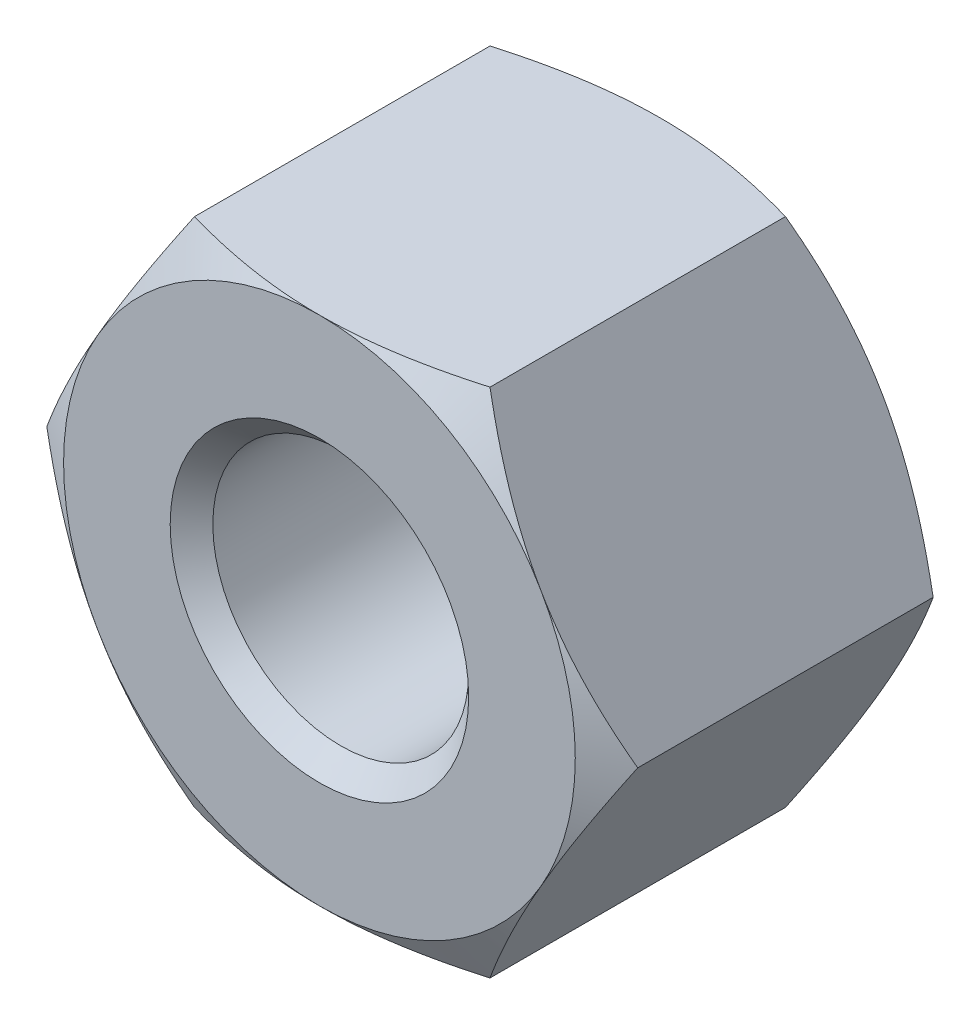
ISO-10303-21;
HEADER;
FILE_DESCRIPTION(('STEP AP214'),'2;1');
FILE_NAME('part.step','',(''),(''),'','','');
FILE_SCHEMA(('AUTOMOTIVE_DESIGN { 1 0 10303 214 1 1 1 1 }'));
ENDSEC;
DATA;
#1=APPLICATION_CONTEXT('core data for automotive mechanical design processes');
#2=APPLICATION_PROTOCOL_DEFINITION('international standard','automotive_design',2000,#1);
#3=PRODUCT_CONTEXT('',#1,'mechanical');
#4=PRODUCT('Part','Part','',(#3));
#5=PRODUCT_RELATED_PRODUCT_CATEGORY('part','',(#4));
#6=PRODUCT_DEFINITION_FORMATION('','',#4);
#7=PRODUCT_DEFINITION_CONTEXT('part definition',#1,'design');
#8=PRODUCT_DEFINITION('design','',#6,#7);
#9=PRODUCT_DEFINITION_SHAPE('','',#8);
#10=(LENGTH_UNIT() NAMED_UNIT(*) SI_UNIT(.MILLI.,.METRE.));
#11=(NAMED_UNIT(*) PLANE_ANGLE_UNIT() SI_UNIT($,.RADIAN.));
#12=(NAMED_UNIT(*) SI_UNIT($,.STERADIAN.) SOLID_ANGLE_UNIT());
#13=UNCERTAINTY_MEASURE_WITH_UNIT(LENGTH_MEASURE(1.E-05),#10,'distance_accuracy_value','');
#14=(GEOMETRIC_REPRESENTATION_CONTEXT(3) GLOBAL_UNCERTAINTY_ASSIGNED_CONTEXT((#13)) GLOBAL_UNIT_ASSIGNED_CONTEXT((#10,
#11,#12)) REPRESENTATION_CONTEXT('',''));
#15=CARTESIAN_POINT('',(0.,0.,0.));
#16=DIRECTION('',(0.,0.,1.));
#17=DIRECTION('',(1.,0.,0.));
#18=AXIS2_PLACEMENT_3D('',#15,#16,#17);
#19=CARTESIAN_POINT('',(3.46410161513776,0.,-2.));
#20=DIRECTION('',(0.866025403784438,0.5,0.));
#21=DIRECTION('',(-0.5,0.866025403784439,0.));
#22=AXIS2_PLACEMENT_3D('',#19,#20,#21);
#23=PLANE('',#22);
#24=CARTESIAN_POINT('',(3.46421708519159,-0.000199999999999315,1.73198413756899));
#25=CARTESIAN_POINT('',(3.38810199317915,0.131635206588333,1.77594629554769));
#26=CARTESIAN_POINT('',(3.31132988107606,0.26460840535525,1.81592841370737));
#27=CARTESIAN_POINT('',(3.15645624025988,0.532857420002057,1.88571791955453));
#28=CARTESIAN_POINT('',(3.078351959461,0.668138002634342,1.91550061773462));
#29=CARTESIAN_POINT('',(2.92311136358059,0.937022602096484,1.96186216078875));
#30=CARTESIAN_POINT('',(2.84599893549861,1.07058524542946,1.97874955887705));
#31=CARTESIAN_POINT('',(2.6914112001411,1.33833905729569,1.99891035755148));
#32=CARTESIAN_POINT('',(2.61393645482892,1.47252925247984,2.00220045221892));
#33=CARTESIAN_POINT('',(2.46916798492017,1.72327559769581,1.99535946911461));
#34=CARTESIAN_POINT('',(2.40185259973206,1.83986926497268,1.98690808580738));
#35=CARTESIAN_POINT('',(2.2676603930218,2.07229698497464,1.96012105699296));
#36=CARTESIAN_POINT('',(2.2007840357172,2.18813023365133,1.94177625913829));
#37=CARTESIAN_POINT('',(2.06631510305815,2.42103725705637,1.89591524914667));
#38=CARTESIAN_POINT('',(1.99873954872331,2.53808155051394,1.86820461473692));
#39=CARTESIAN_POINT('',(1.86459637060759,2.77042435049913,1.8053122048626));
#40=CARTESIAN_POINT('',(1.79802702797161,2.88572583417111,1.77014520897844));
#41=CARTESIAN_POINT('',(1.73193533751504,3.0002,1.73198413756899));
#42=B_SPLINE_CURVE_WITH_KNOTS('',3,(#24,#25,#26,#27,#28,#29,#30,#31,#32,#33,#34,#35,#36,#37,#38,
#39,#40,#41),.UNSPECIFIED.,.F.,.F.,(4,2,2,2,2,2,2,2,4),(0.,0.475539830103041,0.952222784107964,
1.41710776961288,1.88142182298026,2.28572436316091,2.69040156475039,3.10405572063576,
3.5168974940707),.UNSPECIFIED.);
#43=CARTESIAN_POINT('',(3.46410161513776,0.,1.73205080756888));
#44=VERTEX_POINT('',#43);
#45=CARTESIAN_POINT('',(2.59807621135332,1.5,2.));
#46=VERTEX_POINT('',#45);
#47=EDGE_CURVE('E127',#44,#46,#42,.T.);
#48=ORIENTED_EDGE('',*,*,#47,.F.);
#49=DIRECTION('',(0.,0.,1.));
#50=VECTOR('',#49,1.);
#51=CARTESIAN_POINT('',(3.46410161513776,0.,-2.));
#52=LINE('',#51,#50);
#53=CARTESIAN_POINT('',(3.46410161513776,0.,-1.73205080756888));
#54=VERTEX_POINT('',#53);
#55=EDGE_CURVE('E582',#54,#44,#52,.T.);
#56=ORIENTED_EDGE('',*,*,#55,.F.);
#57=CARTESIAN_POINT('',(3.46421708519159,-0.000199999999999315,-1.73198413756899));
#58=CARTESIAN_POINT('',(3.38810199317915,0.131635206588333,-1.77594629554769));
#59=CARTESIAN_POINT('',(3.31132988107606,0.26460840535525,-1.81592841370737));
#60=CARTESIAN_POINT('',(3.15645624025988,0.532857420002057,-1.88571791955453));
#61=CARTESIAN_POINT('',(3.078351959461,0.668138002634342,-1.91550061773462));
#62=CARTESIAN_POINT('',(2.92311136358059,0.937022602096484,-1.96186216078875));
#63=CARTESIAN_POINT('',(2.84599893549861,1.07058524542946,-1.97874955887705));
#64=CARTESIAN_POINT('',(2.6914112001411,1.33833905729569,-1.99891035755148));
#65=CARTESIAN_POINT('',(2.61393645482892,1.47252925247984,-2.00220045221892));
#66=CARTESIAN_POINT('',(2.46916798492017,1.72327559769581,-1.99535946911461));
#67=CARTESIAN_POINT('',(2.40185259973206,1.83986926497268,-1.98690808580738));
#68=CARTESIAN_POINT('',(2.2676603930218,2.07229698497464,-1.96012105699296));
#69=CARTESIAN_POINT('',(2.2007840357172,2.18813023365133,-1.94177625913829));
#70=CARTESIAN_POINT('',(2.06631510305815,2.42103725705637,-1.89591524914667));
#71=CARTESIAN_POINT('',(1.99873954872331,2.53808155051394,-1.86820461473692));
#72=CARTESIAN_POINT('',(1.86459637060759,2.77042435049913,-1.8053122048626));
#73=CARTESIAN_POINT('',(1.79802702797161,2.88572583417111,-1.77014520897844));
#74=CARTESIAN_POINT('',(1.73193533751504,3.0002,-1.73198413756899));
#75=B_SPLINE_CURVE_WITH_KNOTS('',3,(#57,#58,#59,#60,#61,#62,#63,#64,#65,#66,#67,#68,#69,#70,#71,
#72,#73,#74),.UNSPECIFIED.,.F.,.F.,(4,2,2,2,2,2,2,2,4),(0.,0.475539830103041,0.952222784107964,
1.41710776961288,1.88142182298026,2.28572436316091,2.69040156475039,3.10405572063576,
3.5168974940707),.UNSPECIFIED.);
#76=CARTESIAN_POINT('',(2.59807621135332,1.5,-2.));
#77=VERTEX_POINT('',#76);
#78=EDGE_CURVE('E577',#54,#77,#75,.T.);
#79=ORIENTED_EDGE('',*,*,#78,.T.);
#80=CARTESIAN_POINT('',(1.73205080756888,3.,-1.73205080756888));
#81=VERTEX_POINT('',#80);
#82=EDGE_CURVE('E267',#77,#81,#75,.T.);
#83=ORIENTED_EDGE('',*,*,#82,.T.);
#84=DIRECTION('',(0.,0.,1.));
#85=VECTOR('',#84,1.);
#86=CARTESIAN_POINT('',(1.73205080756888,3.,-2.));
#87=LINE('',#86,#85);
#88=CARTESIAN_POINT('',(1.73205080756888,3.,1.73205080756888));
#89=VERTEX_POINT('',#88);
#90=EDGE_CURVE('E159',#81,#89,#87,.T.);
#91=ORIENTED_EDGE('',*,*,#90,.T.);
#92=EDGE_CURVE('E140',#46,#89,#42,.T.);
#93=ORIENTED_EDGE('',*,*,#92,.F.);
#94=EDGE_LOOP('',(#48,#56,#79,#83,#91,#93));
#95=FACE_BOUND('',#94,.T.);
#96=ADVANCED_FACE('F41',(#95),#23,.T.);
#97=CARTESIAN_POINT('',(1.73205080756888,-3.,-2.));
#98=DIRECTION('',(0.866025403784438,-0.5,0.));
#99=DIRECTION('',(0.5,0.866025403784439,0.));
#100=AXIS2_PLACEMENT_3D('',#97,#98,#99);
#101=PLANE('',#100);
#102=CARTESIAN_POINT('',(1.73193533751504,-3.0002,1.73198413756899));
#103=CARTESIAN_POINT('',(1.80805042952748,-2.86836479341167,1.77594629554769));
#104=CARTESIAN_POINT('',(1.88482254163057,-2.73539159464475,1.81592841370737));
#105=CARTESIAN_POINT('',(2.03969618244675,-2.46714257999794,1.88571791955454));
#106=CARTESIAN_POINT('',(2.11780046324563,-2.33186199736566,1.91550061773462));
#107=CARTESIAN_POINT('',(2.27304105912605,-2.06297739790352,1.96186216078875));
#108=CARTESIAN_POINT('',(2.35015348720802,-1.92941475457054,1.97874955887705));
#109=CARTESIAN_POINT('',(2.50474122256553,-1.66166094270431,1.99891035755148));
#110=CARTESIAN_POINT('',(2.58221596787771,-1.52747074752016,2.00220045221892));
#111=CARTESIAN_POINT('',(2.72698443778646,-1.27672440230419,1.99535946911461));
#112=CARTESIAN_POINT('',(2.79429982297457,-1.16013073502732,1.98690808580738));
#113=CARTESIAN_POINT('',(2.92849202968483,-0.927703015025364,1.96012105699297));
#114=CARTESIAN_POINT('',(2.99536838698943,-0.811869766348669,1.94177625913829));
#115=CARTESIAN_POINT('',(3.12983731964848,-0.578962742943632,1.89591524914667));
#116=CARTESIAN_POINT('',(3.19741287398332,-0.461918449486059,1.86820461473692));
#117=CARTESIAN_POINT('',(3.33155605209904,-0.229575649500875,1.8053122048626));
#118=CARTESIAN_POINT('',(3.39812539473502,-0.114274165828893,1.77014520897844));
#119=CARTESIAN_POINT('',(3.46421708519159,0.000200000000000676,1.73198413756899));
#120=B_SPLINE_CURVE_WITH_KNOTS('',3,(#102,#103,#104,#105,#106,#107,#108,#109,#110,#111,#112,
#113,#114,#115,#116,#117,#118,#119),.UNSPECIFIED.,.F.,.F.,(4,2,2,2,2,2,2,2,4),(0.,
0.475539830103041,0.952222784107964,1.41710776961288,1.88142182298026,2.28572436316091,
2.69040156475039,3.10405572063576,3.5168974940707),.UNSPECIFIED.);
#121=CARTESIAN_POINT('',(1.73205080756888,-3.,1.73205080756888));
#122=VERTEX_POINT('',#121);
#123=CARTESIAN_POINT('',(2.59807621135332,-1.5,2.));
#124=VERTEX_POINT('',#123);
#125=EDGE_CURVE('E545',#122,#124,#120,.T.);
#126=ORIENTED_EDGE('',*,*,#125,.F.);
#127=DIRECTION('',(0.,0.,1.));
#128=VECTOR('',#127,1.);
#129=CARTESIAN_POINT('',(1.73205080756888,-3.,-2.));
#130=LINE('',#129,#128);
#131=CARTESIAN_POINT('',(1.73205080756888,-3.,-1.73205080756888));
#132=VERTEX_POINT('',#131);
#133=EDGE_CURVE('E281',#132,#122,#130,.T.);
#134=ORIENTED_EDGE('',*,*,#133,.F.);
#135=CARTESIAN_POINT('',(1.73193533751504,-3.0002,-1.73198413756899));
#136=CARTESIAN_POINT('',(1.80805042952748,-2.86836479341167,-1.77594629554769));
#137=CARTESIAN_POINT('',(1.88482254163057,-2.73539159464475,-1.81592841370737));
#138=CARTESIAN_POINT('',(2.03969618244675,-2.46714257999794,-1.88571791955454));
#139=CARTESIAN_POINT('',(2.11780046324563,-2.33186199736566,-1.91550061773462));
#140=CARTESIAN_POINT('',(2.27304105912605,-2.06297739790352,-1.96186216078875));
#141=CARTESIAN_POINT('',(2.35015348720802,-1.92941475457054,-1.97874955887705));
#142=CARTESIAN_POINT('',(2.50474122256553,-1.66166094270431,-1.99891035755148));
#143=CARTESIAN_POINT('',(2.58221596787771,-1.52747074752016,-2.00220045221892));
#144=CARTESIAN_POINT('',(2.72698443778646,-1.27672440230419,-1.99535946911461));
#145=CARTESIAN_POINT('',(2.79429982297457,-1.16013073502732,-1.98690808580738));
#146=CARTESIAN_POINT('',(2.92849202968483,-0.927703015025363,-1.96012105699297));
#147=CARTESIAN_POINT('',(2.99536838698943,-0.811869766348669,-1.94177625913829));
#148=CARTESIAN_POINT('',(3.12983731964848,-0.578962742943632,-1.89591524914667));
#149=CARTESIAN_POINT('',(3.19741287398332,-0.461918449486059,-1.86820461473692));
#150=CARTESIAN_POINT('',(3.33155605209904,-0.229575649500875,-1.8053122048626));
#151=CARTESIAN_POINT('',(3.39812539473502,-0.114274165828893,-1.77014520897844));
#152=CARTESIAN_POINT('',(3.46421708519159,0.00020000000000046,-1.73198413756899));
#153=B_SPLINE_CURVE_WITH_KNOTS('',3,(#135,#136,#137,#138,#139,#140,#141,#142,#143,#144,#145,
#146,#147,#148,#149,#150,#151,#152),.UNSPECIFIED.,.F.,.F.,(4,2,2,2,2,2,2,2,4),(0.,
0.475539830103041,0.952222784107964,1.41710776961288,1.88142182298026,2.28572436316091,
2.69040156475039,3.10405572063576,3.5168974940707),.UNSPECIFIED.);
#154=CARTESIAN_POINT('',(2.59807621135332,-1.5,-2.));
#155=VERTEX_POINT('',#154);
#156=EDGE_CURVE('E535',#132,#155,#153,.T.);
#157=ORIENTED_EDGE('',*,*,#156,.T.);
#158=EDGE_CURVE('E282',#155,#54,#153,.T.);
#159=ORIENTED_EDGE('',*,*,#158,.T.);
#160=ORIENTED_EDGE('',*,*,#55,.T.);
#161=EDGE_CURVE('E132',#124,#44,#120,.T.);
#162=ORIENTED_EDGE('',*,*,#161,.F.);
#163=EDGE_LOOP('',(#126,#134,#157,#159,#160,#162));
#164=FACE_BOUND('',#163,.T.);
#165=ADVANCED_FACE('F252',(#164),#101,.T.);
#166=CARTESIAN_POINT('',(-1.73205080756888,-3.,-2.));
#167=DIRECTION('',(0.,-1.,0.));
#168=DIRECTION('',(0.,0.,-1.));
#169=AXIS2_PLACEMENT_3D('',#166,#167,#168);
#170=PLANE('',#169);
#171=CARTESIAN_POINT('',(-6.64737187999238,-3.,-0.478552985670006));
#172=CARTESIAN_POINT('',(-6.4951834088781,-3.,-0.398474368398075));
#173=CARTESIAN_POINT('',(-6.34280933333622,-3.,-0.318745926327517));
#174=CARTESIAN_POINT('',(-6.03759777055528,-3.,-0.160167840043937));
#175=CARTESIAN_POINT('',(-5.88476026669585,-3.,-0.0813182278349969));
#176=CARTESIAN_POINT('',(-5.57833824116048,-3.,0.0754214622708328));
#177=CARTESIAN_POINT('',(-5.424752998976,-3.,0.153310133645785));
#178=CARTESIAN_POINT('',(-5.11692303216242,-3.,0.307769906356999));
#179=CARTESIAN_POINT('',(-4.9626783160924,-3.,0.384341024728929));
#180=CARTESIAN_POINT('',(-4.64447657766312,-3.,0.540203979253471));
#181=CARTESIAN_POINT('',(-4.48047179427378,-3.,0.619398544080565));
#182=CARTESIAN_POINT('',(-4.1513449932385,-3.,0.775429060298));
#183=CARTESIAN_POINT('',(-3.98622299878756,-3.,0.852265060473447));
#184=CARTESIAN_POINT('',(-3.65465136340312,-3.,1.00282710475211));
#185=CARTESIAN_POINT('',(-3.48820236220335,-3.,1.07655455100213));
#186=CARTESIAN_POINT('',(-3.15356150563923,-3.,1.21992261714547));
#187=CARTESIAN_POINT('',(-2.98536979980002,-3.,1.28956358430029));
#188=CARTESIAN_POINT('',(-2.62991815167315,-3.,1.43002186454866));
#189=CARTESIAN_POINT('',(-2.44242832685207,-3.,1.50026476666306));
#190=CARTESIAN_POINT('',(-2.06413240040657,-3.,1.63143606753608));
#191=CARTESIAN_POINT('',(-1.87332567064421,-3.,1.69236268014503));
#192=CARTESIAN_POINT('',(-1.49196868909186,-3.,1.79995556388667));
#193=CARTESIAN_POINT('',(-1.30149890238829,-3.,1.84689698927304));
#194=CARTESIAN_POINT('',(-1.01328190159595,-3.,1.9046096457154));
#195=CARTESIAN_POINT('',(-0.91679919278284,-3.,1.92172969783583));
#196=CARTESIAN_POINT('',(-0.723116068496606,-3.,1.95121044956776));
#197=CARTESIAN_POINT('',(-0.625915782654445,-3.,1.96357198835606));
#198=CARTESIAN_POINT('',(-0.428932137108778,-3.,1.98330059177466));
#199=CARTESIAN_POINT('',(-0.329137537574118,-3.,1.99055681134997));
#200=CARTESIAN_POINT('',(-0.129295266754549,-3.,1.99934654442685));
#201=CARTESIAN_POINT('',(-0.029247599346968,-3.,2.00088014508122));
#202=CARTESIAN_POINT('',(0.170764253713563,-3.,1.9981564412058));
#203=CARTESIAN_POINT('',(0.270728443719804,-3.,1.99389946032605));
#204=CARTESIAN_POINT('',(0.470250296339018,-3.,1.9797843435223));
#205=CARTESIAN_POINT('',(0.569807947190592,-3.,1.9699260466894));
#206=CARTESIAN_POINT('',(0.871883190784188,-3.,1.93195007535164));
#207=CARTESIAN_POINT('',(1.07339170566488,-3.,1.89551425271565));
#208=CARTESIAN_POINT('',(1.37264108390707,-3.,1.82805241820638));
#209=CARTESIAN_POINT('',(1.47193345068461,-3.,1.80341622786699));
#210=CARTESIAN_POINT('',(1.6695472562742,-3.,1.75048926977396));
#211=CARTESIAN_POINT('',(1.76786869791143,-3.,1.72219851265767));
#212=CARTESIAN_POINT('',(2.08266300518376,-3.,1.62623349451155));
#213=CARTESIAN_POINT('',(2.29729279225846,-3.,1.5525332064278));
#214=CARTESIAN_POINT('',(2.72277297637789,-3.,1.39489336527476));
#215=CARTESIAN_POINT('',(2.93362150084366,-3.,1.31094889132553));
#216=CARTESIAN_POINT('',(3.3527561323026,-3.,1.13589770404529));
#217=CARTESIAN_POINT('',(3.5610368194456,-3.,1.04477811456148));
#218=CARTESIAN_POINT('',(3.97532046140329,-3.,0.857648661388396));
#219=CARTESIAN_POINT('',(4.18132387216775,-3.,0.761639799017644));
#220=CARTESIAN_POINT('',(4.57754014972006,-3.,0.57281715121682));
#221=CARTESIAN_POINT('',(4.76786503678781,-3.,0.480237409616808));
#222=CARTESIAN_POINT('',(5.14738614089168,-3.,0.292770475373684));
#223=CARTESIAN_POINT('',(5.33658229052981,-3.,0.197883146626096));
#224=CARTESIAN_POINT('',(5.71312103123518,-3.,0.00683503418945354));
#225=CARTESIAN_POINT('',(5.90046815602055,-3.,-0.0893168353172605));
#226=CARTESIAN_POINT('',(6.27442504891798,-3.,-0.282992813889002));
#227=CARTESIAN_POINT('',(6.46103489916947,-3.,-0.380516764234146));
#228=CARTESIAN_POINT('',(6.64737187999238,-3.,-0.478552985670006));
#229=B_SPLINE_CURVE_WITH_KNOTS('',3,(#171,#172,#173,#174,#175,#176,#177,#178,#179,#180,#181,
#182,#183,#184,#185,#186,#187,#188,#189,#190,#191,#192,#193,#194,#195,#196,#197,#198,#199,#200,
#201,#202,#203,#204,#205,#206,#207,#208,#209,#210,#211,#212,#213,#214,#215,#216,#217,#218,#219,
#220,#221,#222,#223,#224,#225,#226,#227,#228),.UNSPECIFIED.,.F.,.F.,(4,2,2,2,2,2,2,2,2,2,2,2,2,
2,2,2,2,2,2,2,2,2,2,2,2,2,2,2,4),(0.,0.51591337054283,1.03184546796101,1.54845972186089,
2.06506729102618,2.61142638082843,3.15777416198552,3.70387281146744,4.24992498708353,
4.85039515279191,5.45098029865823,6.03882183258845,6.33269242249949,6.62651116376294,
6.92652725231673,7.22653877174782,7.52653352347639,7.8265368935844,8.4397088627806,
8.74657620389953,9.05344265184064,9.73379229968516,10.4144700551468,11.0963984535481,
11.7781877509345,12.4131099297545,13.0480696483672,13.6798048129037,14.3114674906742),.UNSPECIFIED.);
#230=CARTESIAN_POINT('',(-1.73205080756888,-3.,1.73205080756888));
#231=VERTEX_POINT('',#230);
#232=CARTESIAN_POINT('',(0.,-3.,2.));
#233=VERTEX_POINT('',#232);
#234=EDGE_CURVE('E546',#231,#233,#229,.T.);
#235=ORIENTED_EDGE('',*,*,#234,.F.);
#236=DIRECTION('',(0.,0.,1.));
#237=VECTOR('',#236,1.);
#238=CARTESIAN_POINT('',(-1.73205080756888,-3.,-2.));
#239=LINE('',#238,#237);
#240=CARTESIAN_POINT('',(-1.73205080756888,-3.,-1.73205080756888));
#241=VERTEX_POINT('',#240);
#242=EDGE_CURVE('E531',#241,#231,#239,.T.);
#243=ORIENTED_EDGE('',*,*,#242,.F.);
#244=CARTESIAN_POINT('',(-5.73225080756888,-3.,0.00330724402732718));
#245=CARTESIAN_POINT('',(-5.59799811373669,-3.,-0.0653576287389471));
#246=CARTESIAN_POINT('',(-5.46354106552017,-3.,-0.133626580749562));
#247=CARTESIAN_POINT('',(-5.19412594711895,-3.,-0.269175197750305));
#248=CARTESIAN_POINT('',(-5.05916786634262,-3.,-0.336454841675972));
#249=CARTESIAN_POINT('',(-4.78843231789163,-3.,-0.46993872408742));
#250=CARTESIAN_POINT('',(-4.65265384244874,-3.,-0.536140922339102));
#251=CARTESIAN_POINT('',(-4.38038885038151,-3.,-0.66708055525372));
#252=CARTESIAN_POINT('',(-4.24390232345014,-3.,-0.731817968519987));
#253=CARTESIAN_POINT('',(-3.96310511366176,-3.,-0.862730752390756));
#254=CARTESIAN_POINT('',(-3.81875010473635,-3.,-0.92881132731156));
#255=CARTESIAN_POINT('',(-3.52890389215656,-3.,-1.05842928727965));
#256=CARTESIAN_POINT('',(-3.38341272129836,-3.,-1.12196674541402));
#257=CARTESIAN_POINT('',(-3.0911428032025,-3.,-1.24573518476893));
#258=CARTESIAN_POINT('',(-2.94436502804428,-3.,-1.30596844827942));
#259=CARTESIAN_POINT('',(-2.64909731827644,-3.,-1.42221294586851));
#260=CARTESIAN_POINT('',(-2.50060697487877,-3.,-1.47822314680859));
#261=CARTESIAN_POINT('',(-2.17495473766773,-3.,-1.59420348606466));
#262=CARTESIAN_POINT('',(-1.99740334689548,-3.,-1.65309774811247));
#263=CARTESIAN_POINT('',(-1.63917764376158,-3.,-1.76029523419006));
#264=CARTESIAN_POINT('',(-1.45850503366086,-3.,-1.80860404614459));
#265=CARTESIAN_POINT('',(-1.09720914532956,-3.,-1.89023263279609));
#266=CARTESIAN_POINT('',(-0.916647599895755,-3.,-1.92381477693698));
#267=CARTESIAN_POINT('',(-0.644079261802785,-3.,-1.96126742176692));
#268=CARTESIAN_POINT('',(-0.552943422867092,-3.,-1.97159787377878));
#269=CARTESIAN_POINT('',(-0.370270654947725,-3.,-1.98763454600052));
#270=CARTESIAN_POINT('',(-0.278733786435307,-3.,-1.99334144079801));
#271=CARTESIAN_POINT('',(-0.0944078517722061,-3.,-1.99996614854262));
#272=CARTESIAN_POINT('',(-0.00161671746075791,-3.,-2.0008268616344));
#273=CARTESIAN_POINT('',(0.183877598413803,-3.,-1.99757525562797));
#274=CARTESIAN_POINT('',(0.27658077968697,-3.,-1.99346292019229));
#275=CARTESIAN_POINT('',(0.461668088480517,-3.,-1.98041370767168));
#276=CARTESIAN_POINT('',(0.554052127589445,-3.,-1.97147558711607));
#277=CARTESIAN_POINT('',(0.738276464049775,-3.,-1.9490819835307));
#278=CARTESIAN_POINT('',(0.830116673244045,-3.,-1.93562578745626));
#279=CARTESIAN_POINT('',(1.1081241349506,-3.,-1.88848678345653));
#280=CARTESIAN_POINT('',(1.29320289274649,-3.,-1.84831083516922));
#281=CARTESIAN_POINT('',(1.65992833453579,-3.,-1.75483304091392));
#282=CARTESIAN_POINT('',(1.8415742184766,-3.,-1.70152817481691));
#283=CARTESIAN_POINT('',(2.18718321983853,-3.,-1.59001482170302));
#284=CARTESIAN_POINT('',(2.35139002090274,-3.,-1.53254960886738));
#285=CARTESIAN_POINT('',(2.67757637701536,-3.,-1.41157770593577));
#286=CARTESIAN_POINT('',(2.83955548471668,-3.,-1.34806982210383));
#287=CARTESIAN_POINT('',(3.16180541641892,-3.,-1.21649668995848));
#288=CARTESIAN_POINT('',(3.32207460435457,-3.,-1.14842746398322));
#289=CARTESIAN_POINT('',(3.64112437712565,-3.,-1.00888164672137));
#290=CARTESIAN_POINT('',(3.79990488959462,-3.,-0.937404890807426));
#291=CARTESIAN_POINT('',(4.10783154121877,-3.,-0.79572041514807));
#292=CARTESIAN_POINT('',(4.25704019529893,-3.,-0.725648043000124));
#293=CARTESIAN_POINT('',(4.55457880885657,-3.,-0.583655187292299));
#294=CARTESIAN_POINT('',(4.70290874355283,-3.,-0.511734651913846));
#295=CARTESIAN_POINT('',(4.99841900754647,-3.,-0.366630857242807));
#296=CARTESIAN_POINT('',(5.14560141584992,-3.,-0.293451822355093));
#297=CARTESIAN_POINT('',(5.43935321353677,-3.,-0.145901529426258));
#298=CARTESIAN_POINT('',(5.58592265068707,-3.,-0.0715303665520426));
#299=CARTESIAN_POINT('',(5.73225080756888,-3.,0.00330724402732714));
#300=B_SPLINE_CURVE_WITH_KNOTS('',3,(#244,#245,#246,#247,#248,#249,#250,#251,#252,#253,#254,
#255,#256,#257,#258,#259,#260,#261,#262,#263,#264,#265,#266,#267,#268,#269,#270,#271,#272,#273,
#274,#275,#276,#277,#278,#279,#280,#281,#282,#283,#284,#285,#286,#287,#288,#289,#290,#291,#292,
#293,#294,#295,#296,#297,#298,#299),.UNSPECIFIED.,.F.,.F.,(4,2,2,2,2,2,2,2,2,2,2,2,2,2,2,2,2,2,
2,2,2,2,2,2,2,2,2,4),(0.,0.452382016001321,0.904773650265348,1.35794045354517,1.81111387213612,
2.2873771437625,2.76362671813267,3.23954308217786,3.71557550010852,4.27652369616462,
4.83717505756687,5.38738613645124,5.66244417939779,5.937462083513,6.21571369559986,
6.4939662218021,6.77229048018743,7.05065868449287,7.61810965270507,8.18569127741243,
8.70745206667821,9.2293161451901,9.75164138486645,10.2739918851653,10.7685068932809,
11.2630357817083,11.756143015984,12.2492110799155),.UNSPECIFIED.);
#301=CARTESIAN_POINT('',(0.,-3.,-2.));
#302=VERTEX_POINT('',#301);
#303=EDGE_CURVE('E559',#241,#302,#300,.T.);
#304=ORIENTED_EDGE('',*,*,#303,.T.);
#305=EDGE_CURVE('E257',#302,#132,#300,.T.);
#306=ORIENTED_EDGE('',*,*,#305,.T.);
#307=ORIENTED_EDGE('',*,*,#133,.T.);
#308=EDGE_CURVE('E138',#233,#122,#229,.T.);
#309=ORIENTED_EDGE('',*,*,#308,.F.);
#310=EDGE_LOOP('',(#235,#243,#304,#306,#307,#309));
#311=FACE_BOUND('',#310,.T.);
#312=ADVANCED_FACE('F290',(#311),#170,.T.);
#313=CARTESIAN_POINT('',(-3.46410161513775,0.,-2.));
#314=DIRECTION('',(-0.866025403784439,-0.5,0.));
#315=DIRECTION('',(0.5,-0.866025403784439,0.));
#316=AXIS2_PLACEMENT_3D('',#313,#314,#315);
#317=PLANE('',#316);
#318=CARTESIAN_POINT('',(-3.46421708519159,0.000200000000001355,1.73198413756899));
#319=CARTESIAN_POINT('',(-3.38810199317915,-0.131635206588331,1.77594629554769));
#320=CARTESIAN_POINT('',(-3.31132988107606,-0.264608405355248,1.81592841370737));
#321=CARTESIAN_POINT('',(-3.15645624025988,-0.532857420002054,1.88571791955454));
#322=CARTESIAN_POINT('',(-3.078351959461,-0.66813800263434,1.91550061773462));
#323=CARTESIAN_POINT('',(-2.92311136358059,-0.937022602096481,1.96186216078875));
#324=CARTESIAN_POINT('',(-2.84599893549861,-1.07058524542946,1.97874955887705));
#325=CARTESIAN_POINT('',(-2.6914112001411,-1.33833905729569,1.99891035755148));
#326=CARTESIAN_POINT('',(-2.61393645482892,-1.47252925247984,2.00220045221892));
#327=CARTESIAN_POINT('',(-2.46916798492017,-1.72327559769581,1.99535946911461));
#328=CARTESIAN_POINT('',(-2.40185259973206,-1.83986926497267,1.98690808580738));
#329=CARTESIAN_POINT('',(-2.2676603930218,-2.07229698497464,1.96012105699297));
#330=CARTESIAN_POINT('',(-2.2007840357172,-2.18813023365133,1.94177625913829));
#331=CARTESIAN_POINT('',(-2.06631510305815,-2.42103725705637,1.89591524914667));
#332=CARTESIAN_POINT('',(-1.99873954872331,-2.53808155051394,1.86820461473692));
#333=CARTESIAN_POINT('',(-1.86459637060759,-2.77042435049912,1.8053122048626));
#334=CARTESIAN_POINT('',(-1.79802702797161,-2.88572583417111,1.77014520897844));
#335=CARTESIAN_POINT('',(-1.73193533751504,-3.0002,1.73198413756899));
#336=B_SPLINE_CURVE_WITH_KNOTS('',3,(#318,#319,#320,#321,#322,#323,#324,#325,#326,#327,#328,
#329,#330,#331,#332,#333,#334,#335),.UNSPECIFIED.,.F.,.F.,(4,2,2,2,2,2,2,2,4),(0.,
0.475539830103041,0.952222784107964,1.41710776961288,1.88142182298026,2.28572436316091,
2.69040156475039,3.10405572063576,3.5168974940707),.UNSPECIFIED.);
#337=CARTESIAN_POINT('',(-3.46410161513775,0.,1.73205080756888));
#338=VERTEX_POINT('',#337);
#339=CARTESIAN_POINT('',(-2.59807621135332,-1.5,2.));
#340=VERTEX_POINT('',#339);
#341=EDGE_CURVE('E175',#338,#340,#336,.T.);
#342=ORIENTED_EDGE('',*,*,#341,.F.);
#343=DIRECTION('',(0.,0.,1.));
#344=VECTOR('',#343,1.);
#345=CARTESIAN_POINT('',(-3.46410161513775,0.,-2.));
#346=LINE('',#345,#344);
#347=CARTESIAN_POINT('',(-3.46410161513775,0.,-1.73205080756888));
#348=VERTEX_POINT('',#347);
#349=EDGE_CURVE('E564',#348,#338,#346,.T.);
#350=ORIENTED_EDGE('',*,*,#349,.F.);
#351=CARTESIAN_POINT('',(-3.46421708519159,0.000200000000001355,-1.73198413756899));
#352=CARTESIAN_POINT('',(-3.38810199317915,-0.131635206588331,-1.77594629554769));
#353=CARTESIAN_POINT('',(-3.31132988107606,-0.264608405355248,-1.81592841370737));
#354=CARTESIAN_POINT('',(-3.15645624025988,-0.532857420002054,-1.88571791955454));
#355=CARTESIAN_POINT('',(-3.078351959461,-0.66813800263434,-1.91550061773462));
#356=CARTESIAN_POINT('',(-2.92311136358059,-0.937022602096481,-1.96186216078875));
#357=CARTESIAN_POINT('',(-2.84599893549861,-1.07058524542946,-1.97874955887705));
#358=CARTESIAN_POINT('',(-2.6914112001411,-1.33833905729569,-1.99891035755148));
#359=CARTESIAN_POINT('',(-2.61393645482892,-1.47252925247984,-2.00220045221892));
#360=CARTESIAN_POINT('',(-2.46916798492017,-1.72327559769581,-1.99535946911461));
#361=CARTESIAN_POINT('',(-2.40185259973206,-1.83986926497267,-1.98690808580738));
#362=CARTESIAN_POINT('',(-2.2676603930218,-2.07229698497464,-1.96012105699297));
#363=CARTESIAN_POINT('',(-2.2007840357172,-2.18813023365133,-1.94177625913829));
#364=CARTESIAN_POINT('',(-2.06631510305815,-2.42103725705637,-1.89591524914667));
#365=CARTESIAN_POINT('',(-1.99873954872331,-2.53808155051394,-1.86820461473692));
#366=CARTESIAN_POINT('',(-1.86459637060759,-2.77042435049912,-1.8053122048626));
#367=CARTESIAN_POINT('',(-1.79802702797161,-2.88572583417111,-1.77014520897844));
#368=CARTESIAN_POINT('',(-1.73193533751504,-3.0002,-1.73198413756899));
#369=B_SPLINE_CURVE_WITH_KNOTS('',3,(#351,#352,#353,#354,#355,#356,#357,#358,#359,#360,#361,
#362,#363,#364,#365,#366,#367,#368),.UNSPECIFIED.,.F.,.F.,(4,2,2,2,2,2,2,2,4),(0.,
0.475539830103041,0.952222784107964,1.41710776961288,1.88142182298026,2.28572436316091,
2.69040156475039,3.10405572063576,3.5168974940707),.UNSPECIFIED.);
#370=CARTESIAN_POINT('',(-2.59807621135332,-1.5,-2.));
#371=VERTEX_POINT('',#370);
#372=EDGE_CURVE('E273',#348,#371,#369,.T.);
#373=ORIENTED_EDGE('',*,*,#372,.T.);
#374=EDGE_CURVE('E280',#371,#241,#369,.T.);
#375=ORIENTED_EDGE('',*,*,#374,.T.);
#376=ORIENTED_EDGE('',*,*,#242,.T.);
#377=EDGE_CURVE('E616',#340,#231,#336,.T.);
#378=ORIENTED_EDGE('',*,*,#377,.F.);
#379=EDGE_LOOP('',(#342,#350,#373,#375,#376,#378));
#380=FACE_BOUND('',#379,.T.);
#381=ADVANCED_FACE('F287',(#380),#317,.T.);
#382=CARTESIAN_POINT('',(-1.73205080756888,3.,-2.));
#383=DIRECTION('',(-0.866025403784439,0.5,0.));
#384=DIRECTION('',(-0.5,-0.866025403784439,0.));
#385=AXIS2_PLACEMENT_3D('',#382,#383,#384);
#386=PLANE('',#385);
#387=CARTESIAN_POINT('',(-1.73193533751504,3.0002,1.73198413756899));
#388=CARTESIAN_POINT('',(-1.80805042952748,2.86836479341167,1.77594629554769));
#389=CARTESIAN_POINT('',(-1.88482254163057,2.73539159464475,1.81592841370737));
#390=CARTESIAN_POINT('',(-2.03969618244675,2.46714257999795,1.88571791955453));
#391=CARTESIAN_POINT('',(-2.11780046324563,2.33186199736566,1.91550061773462));
#392=CARTESIAN_POINT('',(-2.27304105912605,2.06297739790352,1.96186216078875));
#393=CARTESIAN_POINT('',(-2.35015348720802,1.92941475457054,1.97874955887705));
#394=CARTESIAN_POINT('',(-2.50474122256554,1.66166094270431,1.99891035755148));
#395=CARTESIAN_POINT('',(-2.58221596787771,1.52747074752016,2.00220045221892));
#396=CARTESIAN_POINT('',(-2.72698443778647,1.27672440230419,1.99535946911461));
#397=CARTESIAN_POINT('',(-2.79429982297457,1.16013073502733,1.98690808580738));
#398=CARTESIAN_POINT('',(-2.92849202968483,0.927703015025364,1.96012105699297));
#399=CARTESIAN_POINT('',(-2.99536838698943,0.81186976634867,1.94177625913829));
#400=CARTESIAN_POINT('',(-3.12983731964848,0.578962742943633,1.89591524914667));
#401=CARTESIAN_POINT('',(-3.19741287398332,0.46191844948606,1.86820461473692));
#402=CARTESIAN_POINT('',(-3.33155605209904,0.229575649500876,1.8053122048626));
#403=CARTESIAN_POINT('',(-3.39812539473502,0.114274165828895,1.77014520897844));
#404=CARTESIAN_POINT('',(-3.46421708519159,-0.000199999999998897,1.73198413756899));
#405=B_SPLINE_CURVE_WITH_KNOTS('',3,(#387,#388,#389,#390,#391,#392,#393,#394,#395,#396,#397,
#398,#399,#400,#401,#402,#403,#404),.UNSPECIFIED.,.F.,.F.,(4,2,2,2,2,2,2,2,4),(0.,
0.475539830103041,0.952222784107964,1.41710776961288,1.88142182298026,2.28572436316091,
2.69040156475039,3.10405572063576,3.5168974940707),.UNSPECIFIED.);
#406=CARTESIAN_POINT('',(-1.73205080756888,3.,1.73205080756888));
#407=VERTEX_POINT('',#406);
#408=CARTESIAN_POINT('',(-2.59807621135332,1.5,2.));
#409=VERTEX_POINT('',#408);
#410=EDGE_CURVE('E182',#407,#409,#405,.T.);
#411=ORIENTED_EDGE('',*,*,#410,.F.);
#412=DIRECTION('',(0.,0.,1.));
#413=VECTOR('',#412,1.);
#414=CARTESIAN_POINT('',(-1.73205080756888,3.,-2.));
#415=LINE('',#414,#413);
#416=CARTESIAN_POINT('',(-1.73205080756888,3.,-1.73205080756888));
#417=VERTEX_POINT('',#416);
#418=EDGE_CURVE('E231',#417,#407,#415,.T.);
#419=ORIENTED_EDGE('',*,*,#418,.F.);
#420=CARTESIAN_POINT('',(-1.73193533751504,3.0002,-1.73198413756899));
#421=CARTESIAN_POINT('',(-1.80805042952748,2.86836479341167,-1.77594629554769));
#422=CARTESIAN_POINT('',(-1.88482254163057,2.73539159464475,-1.81592841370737));
#423=CARTESIAN_POINT('',(-2.03969618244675,2.46714257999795,-1.88571791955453));
#424=CARTESIAN_POINT('',(-2.11780046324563,2.33186199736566,-1.91550061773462));
#425=CARTESIAN_POINT('',(-2.27304105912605,2.06297739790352,-1.96186216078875));
#426=CARTESIAN_POINT('',(-2.35015348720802,1.92941475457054,-1.97874955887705));
#427=CARTESIAN_POINT('',(-2.50474122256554,1.66166094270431,-1.99891035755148));
#428=CARTESIAN_POINT('',(-2.58221596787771,1.52747074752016,-2.00220045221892));
#429=CARTESIAN_POINT('',(-2.72698443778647,1.27672440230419,-1.99535946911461));
#430=CARTESIAN_POINT('',(-2.79429982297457,1.16013073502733,-1.98690808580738));
#431=CARTESIAN_POINT('',(-2.92849202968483,0.927703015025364,-1.96012105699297));
#432=CARTESIAN_POINT('',(-2.99536838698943,0.81186976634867,-1.94177625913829));
#433=CARTESIAN_POINT('',(-3.12983731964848,0.578962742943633,-1.89591524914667));
#434=CARTESIAN_POINT('',(-3.19741287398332,0.46191844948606,-1.86820461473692));
#435=CARTESIAN_POINT('',(-3.33155605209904,0.229575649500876,-1.8053122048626));
#436=CARTESIAN_POINT('',(-3.39812539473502,0.114274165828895,-1.77014520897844));
#437=CARTESIAN_POINT('',(-3.46421708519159,-0.000199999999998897,-1.73198413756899));
#438=B_SPLINE_CURVE_WITH_KNOTS('',3,(#420,#421,#422,#423,#424,#425,#426,#427,#428,#429,#430,
#431,#432,#433,#434,#435,#436,#437),.UNSPECIFIED.,.F.,.F.,(4,2,2,2,2,2,2,2,4),(0.,
0.475539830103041,0.952222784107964,1.41710776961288,1.88142182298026,2.28572436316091,
2.69040156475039,3.10405572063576,3.5168974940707),.UNSPECIFIED.);
#439=CARTESIAN_POINT('',(-2.59807621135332,1.5,-2.));
#440=VERTEX_POINT('',#439);
#441=EDGE_CURVE('E235',#417,#440,#438,.T.);
#442=ORIENTED_EDGE('',*,*,#441,.T.);
#443=EDGE_CURVE('E566',#440,#348,#438,.T.);
#444=ORIENTED_EDGE('',*,*,#443,.T.);
#445=ORIENTED_EDGE('',*,*,#349,.T.);
#446=EDGE_CURVE('E550',#409,#338,#405,.T.);
#447=ORIENTED_EDGE('',*,*,#446,.F.);
#448=EDGE_LOOP('',(#411,#419,#442,#444,#445,#447));
#449=FACE_BOUND('',#448,.T.);
#450=ADVANCED_FACE('F217',(#449),#386,.T.);
#451=CARTESIAN_POINT('',(1.73205080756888,3.,-2.));
#452=DIRECTION('',(0.,1.,0.));
#453=DIRECTION('',(-1.,0.,0.));
#454=AXIS2_PLACEMENT_3D('',#451,#452,#453);
#455=PLANE('',#454);
#456=CARTESIAN_POINT('',(6.6473718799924,3.,-0.478552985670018));
#457=CARTESIAN_POINT('',(6.49518340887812,3.,-0.398474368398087));
#458=CARTESIAN_POINT('',(6.34280933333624,3.,-0.318745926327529));
#459=CARTESIAN_POINT('',(6.0375977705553,3.,-0.160167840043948));
#460=CARTESIAN_POINT('',(5.88476026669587,3.,-0.0813182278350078));
#461=CARTESIAN_POINT('',(5.5783382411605,3.,0.0754214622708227));
#462=CARTESIAN_POINT('',(5.42475299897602,3.,0.153310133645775));
#463=CARTESIAN_POINT('',(5.11692303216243,3.,0.30776990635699));
#464=CARTESIAN_POINT('',(4.96267831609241,3.,0.384341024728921));
#465=CARTESIAN_POINT('',(4.64447657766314,3.,0.540203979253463));
#466=CARTESIAN_POINT('',(4.48047179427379,3.,0.619398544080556));
#467=CARTESIAN_POINT('',(4.15134499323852,3.,0.775429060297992));
#468=CARTESIAN_POINT('',(3.98622299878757,3.,0.852265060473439));
#469=CARTESIAN_POINT('',(3.65465136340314,3.,1.00282710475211));
#470=CARTESIAN_POINT('',(3.48820236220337,3.,1.07655455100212));
#471=CARTESIAN_POINT('',(3.15356150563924,3.,1.21992261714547));
#472=CARTESIAN_POINT('',(2.98536979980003,3.,1.28956358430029));
#473=CARTESIAN_POINT('',(2.62991815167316,3.,1.43002186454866));
#474=CARTESIAN_POINT('',(2.44242832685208,3.,1.50026476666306));
#475=CARTESIAN_POINT('',(2.06413240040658,3.,1.63143606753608));
#476=CARTESIAN_POINT('',(1.87332567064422,3.,1.69236268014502));
#477=CARTESIAN_POINT('',(1.49196868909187,3.,1.79995556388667));
#478=CARTESIAN_POINT('',(1.3014989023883,3.,1.84689698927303));
#479=CARTESIAN_POINT('',(1.01328190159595,3.,1.90460964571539));
#480=CARTESIAN_POINT('',(0.916799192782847,3.,1.92172969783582));
#481=CARTESIAN_POINT('',(0.723116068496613,3.,1.95121044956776));
#482=CARTESIAN_POINT('',(0.625915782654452,3.,1.96357198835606));
#483=CARTESIAN_POINT('',(0.428932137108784,3.,1.98330059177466));
#484=CARTESIAN_POINT('',(0.329137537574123,3.,1.99055681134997));
#485=CARTESIAN_POINT('',(0.129295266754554,3.,1.99934654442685));
#486=CARTESIAN_POINT('',(0.0292475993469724,3.,2.00088014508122));
#487=CARTESIAN_POINT('',(-0.170764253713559,3.,1.9981564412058));
#488=CARTESIAN_POINT('',(-0.270728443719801,3.,1.99389946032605));
#489=CARTESIAN_POINT('',(-0.470250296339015,3.,1.9797843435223));
#490=CARTESIAN_POINT('',(-0.56980794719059,3.,1.9699260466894));
#491=CARTESIAN_POINT('',(-0.871883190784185,3.,1.93195007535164));
#492=CARTESIAN_POINT('',(-1.07339170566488,3.,1.89551425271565));
#493=CARTESIAN_POINT('',(-1.37264108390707,3.,1.82805241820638));
#494=CARTESIAN_POINT('',(-1.4719334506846,3.,1.80341622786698));
#495=CARTESIAN_POINT('',(-1.6695472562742,3.,1.75048926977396));
#496=CARTESIAN_POINT('',(-1.76786869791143,3.,1.72219851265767));
#497=CARTESIAN_POINT('',(-2.08266300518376,3.,1.62623349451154));
#498=CARTESIAN_POINT('',(-2.29729279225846,3.,1.5525332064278));
#499=CARTESIAN_POINT('',(-2.7227729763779,3.,1.39489336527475));
#500=CARTESIAN_POINT('',(-2.93362150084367,3.,1.31094889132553));
#501=CARTESIAN_POINT('',(-3.35275613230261,3.,1.13589770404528));
#502=CARTESIAN_POINT('',(-3.56103681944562,3.,1.04477811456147));
#503=CARTESIAN_POINT('',(-3.97532046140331,3.,0.857648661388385));
#504=CARTESIAN_POINT('',(-4.18132387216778,3.,0.761639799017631));
#505=CARTESIAN_POINT('',(-4.57754014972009,3.,0.572817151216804));
#506=CARTESIAN_POINT('',(-4.76786503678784,3.,0.480237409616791));
#507=CARTESIAN_POINT('',(-5.14738614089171,3.,0.292770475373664));
#508=CARTESIAN_POINT('',(-5.33658229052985,3.,0.197883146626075));
#509=CARTESIAN_POINT('',(-5.71312103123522,3.,0.00683503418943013));
#510=CARTESIAN_POINT('',(-5.9004681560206,3.,-0.0893168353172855));
#511=CARTESIAN_POINT('',(-6.27442504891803,3.,-0.28299281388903));
#512=CARTESIAN_POINT('',(-6.46103489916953,3.,-0.380516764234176));
#513=CARTESIAN_POINT('',(-6.64737187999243,3.,-0.478552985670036));
#514=B_SPLINE_CURVE_WITH_KNOTS('',3,(#456,#457,#458,#459,#460,#461,#462,#463,#464,#465,#466,
#467,#468,#469,#470,#471,#472,#473,#474,#475,#476,#477,#478,#479,#480,#481,#482,#483,#484,#485,
#486,#487,#488,#489,#490,#491,#492,#493,#494,#495,#496,#497,#498,#499,#500,#501,#502,#503,#504,
#505,#506,#507,#508,#509,#510,#511,#512,#513),.UNSPECIFIED.,.F.,.F.,(4,2,2,2,2,2,2,2,2,2,2,2,2,
2,2,2,2,2,2,2,2,2,2,2,2,2,2,2,4),(0.,0.515913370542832,1.03184546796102,1.5484597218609,
2.06506729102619,2.61142638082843,3.15777416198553,3.70387281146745,4.24992498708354,
4.85039515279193,5.45098029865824,6.03882183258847,6.33269242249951,6.62651116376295,
6.92652725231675,7.22653877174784,7.52653352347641,7.82653689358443,8.43970886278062,
8.74657620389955,9.05344265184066,9.7337922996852,10.4144700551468,11.0963984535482,
11.7781877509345,12.4131099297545,13.0480696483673,13.6798048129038,14.3114674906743),.UNSPECIFIED.);
#515=CARTESIAN_POINT('',(0.,3.,2.));
#516=VERTEX_POINT('',#515);
#517=EDGE_CURVE('E145',#89,#516,#514,.T.);
#518=ORIENTED_EDGE('',*,*,#517,.F.);
#519=ORIENTED_EDGE('',*,*,#90,.F.);
#520=CARTESIAN_POINT('',(5.73225080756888,3.,0.003307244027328));
#521=CARTESIAN_POINT('',(5.59799811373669,3.,-0.0653576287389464));
#522=CARTESIAN_POINT('',(5.46354106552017,3.,-0.133626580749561));
#523=CARTESIAN_POINT('',(5.19412594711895,3.,-0.269175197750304));
#524=CARTESIAN_POINT('',(5.05916786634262,3.,-0.336454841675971));
#525=CARTESIAN_POINT('',(4.78843231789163,3.,-0.469938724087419));
#526=CARTESIAN_POINT('',(4.65265384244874,3.,-0.536140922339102));
#527=CARTESIAN_POINT('',(4.38038885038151,3.,-0.66708055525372));
#528=CARTESIAN_POINT('',(4.24390232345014,3.,-0.731817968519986));
#529=CARTESIAN_POINT('',(3.96310511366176,3.,-0.862730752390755));
#530=CARTESIAN_POINT('',(3.81875010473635,3.,-0.928811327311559));
#531=CARTESIAN_POINT('',(3.52890389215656,3.,-1.05842928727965));
#532=CARTESIAN_POINT('',(3.38341272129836,3.,-1.12196674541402));
#533=CARTESIAN_POINT('',(3.0911428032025,3.,-1.24573518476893));
#534=CARTESIAN_POINT('',(2.94436502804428,3.,-1.30596844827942));
#535=CARTESIAN_POINT('',(2.64909731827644,3.,-1.42221294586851));
#536=CARTESIAN_POINT('',(2.50060697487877,3.,-1.47822314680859));
#537=CARTESIAN_POINT('',(2.17495473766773,3.,-1.59420348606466));
#538=CARTESIAN_POINT('',(1.99740334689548,3.,-1.65309774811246));
#539=CARTESIAN_POINT('',(1.63917764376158,3.,-1.76029523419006));
#540=CARTESIAN_POINT('',(1.45850503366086,3.,-1.80860404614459));
#541=CARTESIAN_POINT('',(1.09720914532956,3.,-1.89023263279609));
#542=CARTESIAN_POINT('',(0.916647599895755,3.,-1.92381477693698));
#543=CARTESIAN_POINT('',(0.644079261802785,3.,-1.96126742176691));
#544=CARTESIAN_POINT('',(0.552943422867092,3.,-1.97159787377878));
#545=CARTESIAN_POINT('',(0.370270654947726,3.,-1.98763454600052));
#546=CARTESIAN_POINT('',(0.278733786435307,3.,-1.993341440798));
#547=CARTESIAN_POINT('',(0.0944078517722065,3.,-1.99996614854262));
#548=CARTESIAN_POINT('',(0.00161671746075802,3.,-2.0008268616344));
#549=CARTESIAN_POINT('',(-0.183877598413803,3.,-1.99757525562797));
#550=CARTESIAN_POINT('',(-0.27658077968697,3.,-1.99346292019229));
#551=CARTESIAN_POINT('',(-0.461668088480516,3.,-1.98041370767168));
#552=CARTESIAN_POINT('',(-0.554052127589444,3.,-1.97147558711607));
#553=CARTESIAN_POINT('',(-0.738276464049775,3.,-1.9490819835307));
#554=CARTESIAN_POINT('',(-0.830116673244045,3.,-1.93562578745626));
#555=CARTESIAN_POINT('',(-1.1081241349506,3.,-1.88848678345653));
#556=CARTESIAN_POINT('',(-1.29320289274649,3.,-1.84831083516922));
#557=CARTESIAN_POINT('',(-1.65992833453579,3.,-1.75483304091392));
#558=CARTESIAN_POINT('',(-1.8415742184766,3.,-1.70152817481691));
#559=CARTESIAN_POINT('',(-2.18718321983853,3.,-1.59001482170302));
#560=CARTESIAN_POINT('',(-2.35139002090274,3.,-1.53254960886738));
#561=CARTESIAN_POINT('',(-2.67757637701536,3.,-1.41157770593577));
#562=CARTESIAN_POINT('',(-2.83955548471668,3.,-1.34806982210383));
#563=CARTESIAN_POINT('',(-3.16180541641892,3.,-1.21649668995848));
#564=CARTESIAN_POINT('',(-3.32207460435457,3.,-1.14842746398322));
#565=CARTESIAN_POINT('',(-3.64112437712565,3.,-1.00888164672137));
#566=CARTESIAN_POINT('',(-3.79990488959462,3.,-0.937404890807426));
#567=CARTESIAN_POINT('',(-4.10783154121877,3.,-0.79572041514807));
#568=CARTESIAN_POINT('',(-4.25704019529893,3.,-0.725648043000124));
#569=CARTESIAN_POINT('',(-4.55457880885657,3.,-0.583655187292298));
#570=CARTESIAN_POINT('',(-4.70290874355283,3.,-0.511734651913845));
#571=CARTESIAN_POINT('',(-4.99841900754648,3.,-0.366630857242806));
#572=CARTESIAN_POINT('',(-5.14560141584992,3.,-0.293451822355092));
#573=CARTESIAN_POINT('',(-5.43935321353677,3.,-0.145901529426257));
#574=CARTESIAN_POINT('',(-5.58592265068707,3.,-0.0715303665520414));
#575=CARTESIAN_POINT('',(-5.73225080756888,3.,0.00330724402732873));
#576=B_SPLINE_CURVE_WITH_KNOTS('',3,(#520,#521,#522,#523,#524,#525,#526,#527,#528,#529,#530,
#531,#532,#533,#534,#535,#536,#537,#538,#539,#540,#541,#542,#543,#544,#545,#546,#547,#548,#549,
#550,#551,#552,#553,#554,#555,#556,#557,#558,#559,#560,#561,#562,#563,#564,#565,#566,#567,#568,
#569,#570,#571,#572,#573,#574,#575),.UNSPECIFIED.,.F.,.F.,(4,2,2,2,2,2,2,2,2,2,2,2,2,2,2,2,2,2,
2,2,2,2,2,2,2,2,2,4),(0.,0.452382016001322,0.904773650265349,1.35794045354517,1.81111387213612,
2.2873771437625,2.76362671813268,3.23954308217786,3.71557550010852,4.27652369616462,
4.83717505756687,5.38738613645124,5.66244417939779,5.937462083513,6.21571369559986,
6.4939662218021,6.77229048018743,7.05065868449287,7.61810965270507,8.18569127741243,
8.70745206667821,9.2293161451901,9.75164138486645,10.2739918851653,10.7685068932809,
11.2630357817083,11.756143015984,12.2492110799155),.UNSPECIFIED.);
#577=CARTESIAN_POINT('',(0.,3.,-2.));
#578=VERTEX_POINT('',#577);
#579=EDGE_CURVE('E232',#81,#578,#576,.T.);
#580=ORIENTED_EDGE('',*,*,#579,.T.);
#581=EDGE_CURVE('E222',#578,#417,#576,.T.);
#582=ORIENTED_EDGE('',*,*,#581,.T.);
#583=ORIENTED_EDGE('',*,*,#418,.T.);
#584=EDGE_CURVE('E161',#516,#407,#514,.T.);
#585=ORIENTED_EDGE('',*,*,#584,.F.);
#586=EDGE_LOOP('',(#518,#519,#580,#582,#583,#585));
#587=FACE_BOUND('',#586,.T.);
#588=ADVANCED_FACE('F213',(#587),#455,.T.);
#589=CARTESIAN_POINT('',(0.,0.,-2.));
#590=DIRECTION('',(0.,0.,1.));
#591=DIRECTION('',(-1.,0.,0.));
#592=AXIS2_PLACEMENT_3D('',#589,#590,#591);
#593=CONICAL_SURFACE('',#592,3.,1.0471975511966);
#594=CARTESIAN_POINT('',(0.,0.,-2.));
#595=DIRECTION('',(0.,0.,1.));
#596=DIRECTION('',(1.,0.,0.));
#597=AXIS2_PLACEMENT_3D('',#594,#595,#596);
#598=CIRCLE('',#597,3.);
#599=EDGE_CURVE('E526',#155,#77,#598,.T.);
#600=ORIENTED_EDGE('',*,*,#599,.T.);
#601=ORIENTED_EDGE('',*,*,#78,.F.);
#602=ORIENTED_EDGE('',*,*,#158,.F.);
#603=EDGE_LOOP('',(#600,#601,#602));
#604=FACE_BOUND('',#603,.T.);
#605=ADVANCED_FACE('F216',(#604),#593,.T.);
#606=EDGE_CURVE('E529',#302,#155,#598,.T.);
#607=ORIENTED_EDGE('',*,*,#606,.T.);
#608=ORIENTED_EDGE('',*,*,#156,.F.);
#609=ORIENTED_EDGE('',*,*,#305,.F.);
#610=EDGE_LOOP('',(#607,#608,#609));
#611=FACE_BOUND('',#610,.T.);
#612=ADVANCED_FACE('F335',(#611),#593,.T.);
#613=ORIENTED_EDGE('',*,*,#374,.F.);
#614=EDGE_CURVE('E601',#371,#302,#598,.T.);
#615=ORIENTED_EDGE('',*,*,#614,.T.);
#616=ORIENTED_EDGE('',*,*,#303,.F.);
#617=EDGE_LOOP('',(#613,#615,#616));
#618=FACE_BOUND('',#617,.T.);
#619=ADVANCED_FACE('F249',(#618),#593,.T.);
#620=ORIENTED_EDGE('',*,*,#443,.F.);
#621=EDGE_CURVE('E548',#440,#371,#598,.T.);
#622=ORIENTED_EDGE('',*,*,#621,.T.);
#623=ORIENTED_EDGE('',*,*,#372,.F.);
#624=EDGE_LOOP('',(#620,#622,#623));
#625=FACE_BOUND('',#624,.T.);
#626=ADVANCED_FACE('F247',(#625),#593,.T.);
#627=ORIENTED_EDGE('',*,*,#581,.F.);
#628=CARTESIAN_POINT('',(0.,0.,-2.));
#629=DIRECTION('',(0.,0.,-1.));
#630=DIRECTION('',(-1.,0.,0.));
#631=AXIS2_PLACEMENT_3D('',#628,#629,#630);
#632=CIRCLE('',#631,3.);
#633=EDGE_CURVE('E233',#440,#578,#632,.T.);
#634=ORIENTED_EDGE('',*,*,#633,.F.);
#635=ORIENTED_EDGE('',*,*,#441,.F.);
#636=EDGE_LOOP('',(#627,#634,#635));
#637=FACE_BOUND('',#636,.T.);
#638=ADVANCED_FACE('F241',(#637),#593,.T.);
#639=EDGE_CURVE('E530',#77,#578,#598,.T.);
#640=ORIENTED_EDGE('',*,*,#639,.T.);
#641=ORIENTED_EDGE('',*,*,#579,.F.);
#642=ORIENTED_EDGE('',*,*,#82,.F.);
#643=EDGE_LOOP('',(#640,#641,#642));
#644=FACE_BOUND('',#643,.T.);
#645=ADVANCED_FACE('F246',(#644),#593,.T.);
#646=CARTESIAN_POINT('',(0.,0.,-2.));
#647=DIRECTION('',(0.,0.,1.));
#648=DIRECTION('',(1.,0.,0.));
#649=AXIS2_PLACEMENT_3D('',#646,#647,#648);
#650=PLANE('',#649);
#651=CARTESIAN_POINT('',(0.,0.,-2.));
#652=DIRECTION('',(0.,0.,1.));
#653=DIRECTION('',(1.,0.,0.));
#654=AXIS2_PLACEMENT_3D('',#651,#652,#653);
#655=CIRCLE('',#654,1.75);
#656=CARTESIAN_POINT('',(1.75,0.,-2.));
#657=VERTEX_POINT('',#656);
#658=EDGE_CURVE('E543',#657,#657,#655,.T.);
#659=ORIENTED_EDGE('',*,*,#658,.T.);
#660=EDGE_LOOP('',(#659));
#661=FACE_BOUND('',#660,.T.);
#662=ORIENTED_EDGE('',*,*,#639,.F.);
#663=ORIENTED_EDGE('',*,*,#599,.F.);
#664=ORIENTED_EDGE('',*,*,#606,.F.);
#665=ORIENTED_EDGE('',*,*,#614,.F.);
#666=ORIENTED_EDGE('',*,*,#621,.F.);
#667=ORIENTED_EDGE('',*,*,#633,.T.);
#668=EDGE_LOOP('',(#662,#663,#664,#665,#666,#667));
#669=FACE_BOUND('',#668,.T.);
#670=ADVANCED_FACE('F369',(#661,#669),#650,.F.);
#671=CARTESIAN_POINT('',(0.,0.,0.));
#672=DIRECTION('',(0.,0.,-1.));
#673=DIRECTION('',(-1.,0.,0.));
#674=AXIS2_PLACEMENT_3D('',#671,#672,#673);
#675=CYLINDRICAL_SURFACE('',#674,1.5);
#676=CARTESIAN_POINT('',(0.,0.,1.75));
#677=DIRECTION('',(0.,0.,-1.));
#678=DIRECTION('',(-1.,0.,0.));
#679=AXIS2_PLACEMENT_3D('',#676,#677,#678);
#680=CIRCLE('',#679,1.5);
#681=CARTESIAN_POINT('',(-1.5,0.,1.75));
#682=VERTEX_POINT('',#681);
#683=EDGE_CURVE('E12',#682,#682,#680,.F.);
#684=ORIENTED_EDGE('',*,*,#683,.T.);
#685=EDGE_LOOP('',(#684));
#686=FACE_BOUND('',#685,.T.);
#687=CARTESIAN_POINT('',(0.,0.,-1.75));
#688=DIRECTION('',(0.,0.,1.));
#689=DIRECTION('',(1.,0.,0.));
#690=AXIS2_PLACEMENT_3D('',#687,#688,#689);
#691=CIRCLE('',#690,1.5);
#692=CARTESIAN_POINT('',(1.5,0.,-1.75));
#693=VERTEX_POINT('',#692);
#694=EDGE_CURVE('E538',#693,#693,#691,.F.);
#695=ORIENTED_EDGE('',*,*,#694,.T.);
#696=EDGE_LOOP('',(#695));
#697=FACE_BOUND('',#696,.T.);
#698=ADVANCED_FACE('F250',(#686,#697),#675,.F.);
#699=CARTESIAN_POINT('',(0.,0.,-1.75));
#700=DIRECTION('',(0.,0.,-1.));
#701=DIRECTION('',(-1.,0.,0.));
#702=AXIS2_PLACEMENT_3D('',#699,#700,#701);
#703=CONICAL_SURFACE('',#702,1.5,0.785398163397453);
#704=ORIENTED_EDGE('',*,*,#658,.F.);
#705=EDGE_LOOP('',(#704));
#706=FACE_BOUND('',#705,.T.);
#707=ORIENTED_EDGE('',*,*,#694,.F.);
#708=EDGE_LOOP('',(#707));
#709=FACE_BOUND('',#708,.T.);
#710=ADVANCED_FACE('F384',(#706,#709),#703,.F.);
#711=CARTESIAN_POINT('',(0.,0.,2.));
#712=DIRECTION('',(0.,0.,-1.));
#713=DIRECTION('',(-1.,0.,0.));
#714=AXIS2_PLACEMENT_3D('',#711,#712,#713);
#715=CONICAL_SURFACE('',#714,3.,1.0471975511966);
#716=ORIENTED_EDGE('',*,*,#341,.T.);
#717=CARTESIAN_POINT('',(0.,0.,2.));
#718=DIRECTION('',(0.,0.,-1.));
#719=DIRECTION('',(-1.,0.,0.));
#720=AXIS2_PLACEMENT_3D('',#717,#718,#719);
#721=CIRCLE('',#720,3.);
#722=EDGE_CURVE('E149',#409,#340,#721,.F.);
#723=ORIENTED_EDGE('',*,*,#722,.F.);
#724=ORIENTED_EDGE('',*,*,#446,.T.);
#725=EDGE_LOOP('',(#716,#723,#724));
#726=FACE_BOUND('',#725,.T.);
#727=ADVANCED_FACE('F193',(#726),#715,.T.);
#728=ORIENTED_EDGE('',*,*,#410,.T.);
#729=CARTESIAN_POINT('',(0.,0.,2.));
#730=DIRECTION('',(0.,0.,-1.));
#731=DIRECTION('',(-1.,0.,0.));
#732=AXIS2_PLACEMENT_3D('',#729,#730,#731);
#733=CIRCLE('',#732,3.);
#734=EDGE_CURVE('E166',#409,#516,#733,.T.);
#735=ORIENTED_EDGE('',*,*,#734,.T.);
#736=ORIENTED_EDGE('',*,*,#584,.T.);
#737=EDGE_LOOP('',(#728,#735,#736));
#738=FACE_BOUND('',#737,.T.);
#739=ADVANCED_FACE('F190',(#738),#715,.T.);
#740=ORIENTED_EDGE('',*,*,#92,.T.);
#741=ORIENTED_EDGE('',*,*,#517,.T.);
#742=EDGE_CURVE('E59',#46,#516,#721,.F.);
#743=ORIENTED_EDGE('',*,*,#742,.F.);
#744=EDGE_LOOP('',(#740,#741,#743));
#745=FACE_BOUND('',#744,.T.);
#746=ADVANCED_FACE('F143',(#745),#715,.T.);
#747=ORIENTED_EDGE('',*,*,#161,.T.);
#748=ORIENTED_EDGE('',*,*,#47,.T.);
#749=EDGE_CURVE('E129',#124,#46,#721,.F.);
#750=ORIENTED_EDGE('',*,*,#749,.F.);
#751=EDGE_LOOP('',(#747,#748,#750));
#752=FACE_BOUND('',#751,.T.);
#753=ADVANCED_FACE('F128',(#752),#715,.T.);
#754=ORIENTED_EDGE('',*,*,#308,.T.);
#755=ORIENTED_EDGE('',*,*,#125,.T.);
#756=EDGE_CURVE('E154',#233,#124,#721,.F.);
#757=ORIENTED_EDGE('',*,*,#756,.F.);
#758=EDGE_LOOP('',(#754,#755,#757));
#759=FACE_BOUND('',#758,.T.);
#760=ADVANCED_FACE('F418',(#759),#715,.T.);
#761=ORIENTED_EDGE('',*,*,#234,.T.);
#762=EDGE_CURVE('E556',#340,#233,#721,.F.);
#763=ORIENTED_EDGE('',*,*,#762,.F.);
#764=ORIENTED_EDGE('',*,*,#377,.T.);
#765=EDGE_LOOP('',(#761,#763,#764));
#766=FACE_BOUND('',#765,.T.);
#767=ADVANCED_FACE('F195',(#766),#715,.T.);
#768=CARTESIAN_POINT('',(0.,0.,2.));
#769=DIRECTION('',(0.,0.,-1.));
#770=DIRECTION('',(1.,0.,0.));
#771=AXIS2_PLACEMENT_3D('',#768,#769,#770);
#772=PLANE('',#771);
#773=CARTESIAN_POINT('',(0.,0.,2.));
#774=DIRECTION('',(0.,0.,-1.));
#775=DIRECTION('',(-1.,0.,0.));
#776=AXIS2_PLACEMENT_3D('',#773,#774,#775);
#777=CIRCLE('',#776,1.75);
#778=CARTESIAN_POINT('',(-1.75,0.,2.));
#779=VERTEX_POINT('',#778);
#780=EDGE_CURVE('E51',#779,#779,#777,.T.);
#781=ORIENTED_EDGE('',*,*,#780,.T.);
#782=EDGE_LOOP('',(#781));
#783=FACE_BOUND('',#782,.T.);
#784=ORIENTED_EDGE('',*,*,#722,.T.);
#785=ORIENTED_EDGE('',*,*,#762,.T.);
#786=ORIENTED_EDGE('',*,*,#756,.T.);
#787=ORIENTED_EDGE('',*,*,#749,.T.);
#788=ORIENTED_EDGE('',*,*,#742,.T.);
#789=ORIENTED_EDGE('',*,*,#734,.F.);
#790=EDGE_LOOP('',(#784,#785,#786,#787,#788,#789));
#791=FACE_BOUND('',#790,.T.);
#792=ADVANCED_FACE('F151',(#783,#791),#772,.F.);
#793=CARTESIAN_POINT('',(0.,0.,2.));
#794=DIRECTION('',(0.,0.,1.));
#795=DIRECTION('',(1.,0.,0.));
#796=AXIS2_PLACEMENT_3D('',#793,#794,#795);
#797=CONICAL_SURFACE('',#796,1.75,0.785398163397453);
#798=ORIENTED_EDGE('',*,*,#683,.F.);
#799=EDGE_LOOP('',(#798));
#800=FACE_BOUND('',#799,.T.);
#801=ORIENTED_EDGE('',*,*,#780,.F.);
#802=EDGE_LOOP('',(#801));
#803=FACE_BOUND('',#802,.T.);
#804=ADVANCED_FACE('F43',(#800,#803),#797,.F.);
#805=CLOSED_SHELL('',(#96,#165,#312,#381,#450,#588,#605,#612,#619,#626,#638,#645,#670,#698,#710,
#727,#739,#746,#753,#760,#767,#792,#804));
#806=MANIFOLD_SOLID_BREP('B2',#805);
#807=ADVANCED_BREP_SHAPE_REPRESENTATION('',(#18,#806),#14);
#808=SHAPE_DEFINITION_REPRESENTATION(#9,#807);
ENDSEC;
END-ISO-10303-21;
